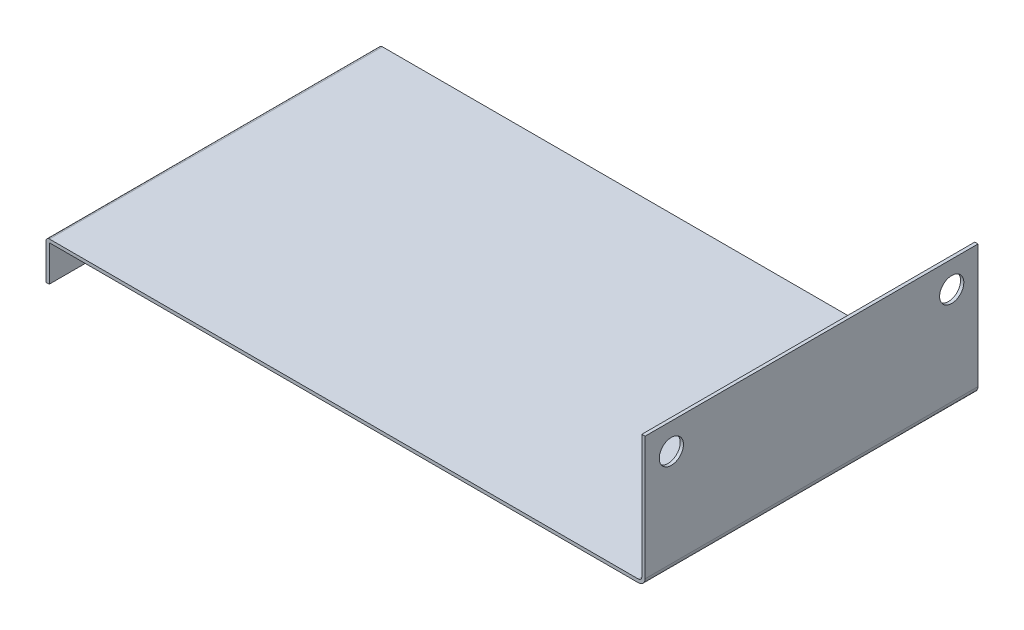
from build123d import *

# Parameters (mm, degrees)
EXTRUDE_THIN1_DEPTH = 120.65
CUT_EXTRUDE1_START  = -434.1622
SKETCH3_R           = 8.763
SKETCH3_R_2         = 5.207
CUT_EXTRUDE1_DEPTH  = 434.1622


with BuildPart() as part:
    # Sketch1 → Extrude-Thin1 (new, symmetric)
    with BuildSketch(Plane.XY):
        with BuildLine():
            Line((-215.9, -28.448), (-215.9, -2.54))
            ThreePointArc((-215.9, -2.54), (-215.156051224, -0.743948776), (-213.36, 0))
            Line((-213.36, 0), (213.36, 0))
            ThreePointArc((213.36, 0), (215.156051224, 0.743948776), (215.9, 2.54))
            Line((215.9, 2.54), (215.9, 92.075))
            Line((215.9, 92.075), (218.2622, 92.075))
            Line((218.2622, 92.075), (218.2622, 2.54))
            ThreePointArc((218.2622, 2.54), (216.826378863, -0.926378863), (213.36, -2.3622))
            Line((213.36, -2.3622), (-213.36, -2.3622))
            ThreePointArc((-213.36, -2.3622), (-213.485723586, -2.414276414), (-213.5378, -2.54))
            Line((-213.5378, -2.54), (-213.5378, -28.448))
            Line((-213.5378, -28.448), (-215.9, -28.448))
        make_face()
    extrude(amount=EXTRUDE_THIN1_DEPTH, both=True)

    # Sketch3 → Cut-Extrude1 (cut)
    with BuildSketch(Plane(origin=(218.2622, 0, 0), x_dir=(0, 0, -1), z_dir=(1, 0, 0)).offset(CUT_EXTRUDE1_START)):
        with Locations(Location((-101.6, 73.025, 0), (0, 0, 90))):
            Circle(SKETCH3_R)
        with Locations(Location((101.6, 73.025, 0), (0, 0, 90))):
            Circle(SKETCH3_R)
        with Locations(Location((-88.9, -15.748, 0), (0, 0, 90))):
            Circle(SKETCH3_R_2)
        with Locations(Location((88.9, -15.748, 0), (0, 0, 90))):
            Circle(SKETCH3_R_2)
    extrude(amount=CUT_EXTRUDE1_DEPTH, mode=Mode.SUBTRACT)


solid = part.part
